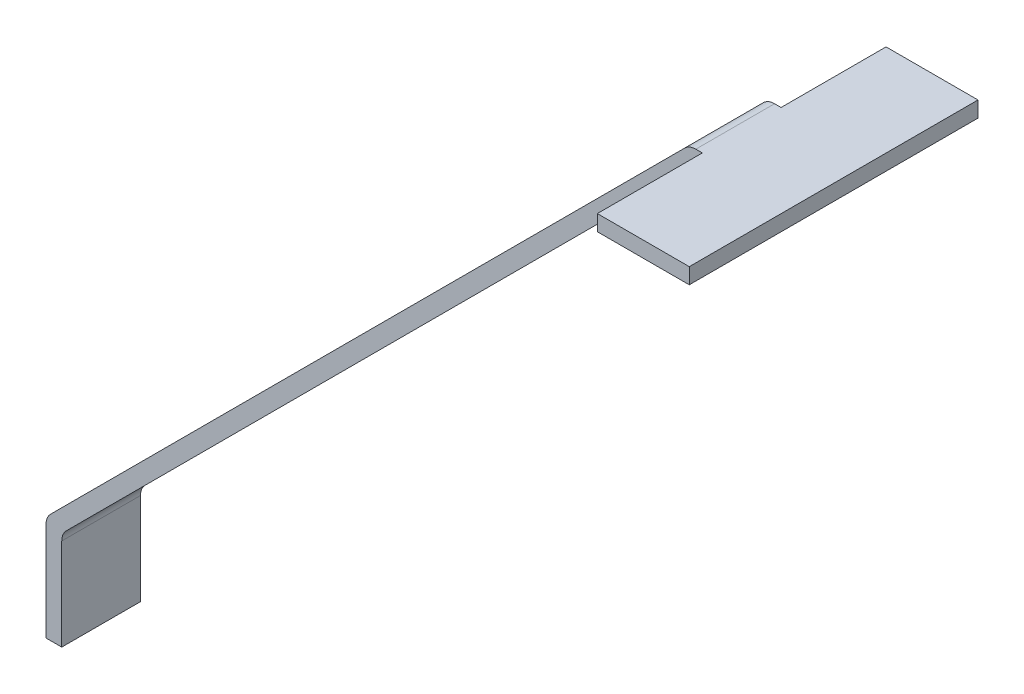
ISO-10303-21;
HEADER;
FILE_DESCRIPTION(('STEP AP214'),'2;1');
FILE_NAME('part.step','',(''),(''),'','','');
FILE_SCHEMA(('AUTOMOTIVE_DESIGN { 1 0 10303 214 1 1 1 1 }'));
ENDSEC;
DATA;
#1=APPLICATION_CONTEXT('core data for automotive mechanical design processes');
#2=APPLICATION_PROTOCOL_DEFINITION('international standard','automotive_design',2000,#1);
#3=PRODUCT_CONTEXT('',#1,'mechanical');
#4=PRODUCT('Part','Part','',(#3));
#5=PRODUCT_RELATED_PRODUCT_CATEGORY('part','',(#4));
#6=PRODUCT_DEFINITION_FORMATION('','',#4);
#7=PRODUCT_DEFINITION_CONTEXT('part definition',#1,'design');
#8=PRODUCT_DEFINITION('design','',#6,#7);
#9=PRODUCT_DEFINITION_SHAPE('','',#8);
#10=(LENGTH_UNIT() NAMED_UNIT(*) SI_UNIT(.MILLI.,.METRE.));
#11=(NAMED_UNIT(*) PLANE_ANGLE_UNIT() SI_UNIT($,.RADIAN.));
#12=(NAMED_UNIT(*) SI_UNIT($,.STERADIAN.) SOLID_ANGLE_UNIT());
#13=UNCERTAINTY_MEASURE_WITH_UNIT(LENGTH_MEASURE(1.E-05),#10,'distance_accuracy_value','');
#14=(GEOMETRIC_REPRESENTATION_CONTEXT(3) GLOBAL_UNCERTAINTY_ASSIGNED_CONTEXT((#13)) GLOBAL_UNIT_ASSIGNED_CONTEXT((#10,
#11,#12)) REPRESENTATION_CONTEXT('',''));
#15=CARTESIAN_POINT('',(0.,0.,0.));
#16=DIRECTION('',(0.,0.,1.));
#17=DIRECTION('',(1.,0.,0.));
#18=AXIS2_PLACEMENT_3D('',#15,#16,#17);
#19=CARTESIAN_POINT('',(0.,0.,15.));
#20=DIRECTION('',(0.,0.,-1.));
#21=DIRECTION('',(-1.,0.,0.));
#22=AXIS2_PLACEMENT_3D('',#19,#20,#21);
#23=PLANE('',#22);
#24=DIRECTION('',(0.,-1.,0.));
#25=VECTOR('',#24,1.);
#26=CARTESIAN_POINT('',(125.026886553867,122.541605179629,15.));
#27=LINE('',#26,#25);
#28=CARTESIAN_POINT('',(125.026886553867,122.541605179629,15.));
#29=VERTEX_POINT('',#28);
#30=CARTESIAN_POINT('',(125.026886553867,119.541605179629,15.));
#31=VERTEX_POINT('',#30);
#32=EDGE_CURVE('E54',#29,#31,#27,.T.);
#33=ORIENTED_EDGE('',*,*,#32,.F.);
#34=DIRECTION('',(-1.,0.,0.));
#35=VECTOR('',#34,1.);
#36=CARTESIAN_POINT('',(122.541605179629,122.541605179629,15.));
#37=LINE('',#36,#35);
#38=CARTESIAN_POINT('',(123.784245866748,122.541605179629,15.));
#39=VERTEX_POINT('',#38);
#40=EDGE_CURVE('E58',#29,#39,#37,.T.);
#41=ORIENTED_EDGE('',*,*,#40,.T.);
#42=CARTESIAN_POINT('',(123.784245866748,119.541605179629,15.));
#43=DIRECTION('',(0.,0.,-1.));
#44=DIRECTION('',(-1.,0.,0.));
#45=AXIS2_PLACEMENT_3D('',#42,#43,#44);
#46=CIRCLE('',#45,3.);
#47=CARTESIAN_POINT('',(121.662925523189,121.662925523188,15.));
#48=VERTEX_POINT('',#47);
#49=EDGE_CURVE('E285',#39,#48,#46,.F.);
#50=ORIENTED_EDGE('',*,*,#49,.T.);
#51=DIRECTION('',(-0.707106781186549,-0.707106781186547,0.));
#52=VECTOR('',#51,1.);
#53=CARTESIAN_POINT('',(0.,0.,15.));
#54=LINE('',#53,#52);
#55=CARTESIAN_POINT('',(0.87867965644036,0.878679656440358,15.));
#56=VERTEX_POINT('',#55);
#57=EDGE_CURVE('E221',#48,#56,#54,.T.);
#58=ORIENTED_EDGE('',*,*,#57,.T.);
#59=CARTESIAN_POINT('',(3.,-1.24264068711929,15.));
#60=DIRECTION('',(0.,0.,-1.));
#61=DIRECTION('',(-1.,0.,0.));
#62=AXIS2_PLACEMENT_3D('',#59,#60,#61);
#63=CIRCLE('',#62,3.);
#64=CARTESIAN_POINT('',(0.,-1.24264068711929,15.));
#65=VERTEX_POINT('',#64);
#66=EDGE_CURVE('E288',#56,#65,#63,.F.);
#67=ORIENTED_EDGE('',*,*,#66,.T.);
#68=DIRECTION('',(0.,-1.,0.));
#69=VECTOR('',#68,1.);
#70=CARTESIAN_POINT('',(0.,-20.,15.));
#71=LINE('',#70,#69);
#72=CARTESIAN_POINT('',(0.,-20.,15.));
#73=VERTEX_POINT('',#72);
#74=EDGE_CURVE('E204',#65,#73,#71,.T.);
#75=ORIENTED_EDGE('',*,*,#74,.T.);
#76=DIRECTION('',(1.,0.,0.));
#77=VECTOR('',#76,1.);
#78=CARTESIAN_POINT('',(3.,-20.,15.));
#79=LINE('',#78,#77);
#80=CARTESIAN_POINT('',(3.,-20.,15.));
#81=VERTEX_POINT('',#80);
#82=EDGE_CURVE('E207',#73,#81,#79,.T.);
#83=ORIENTED_EDGE('',*,*,#82,.T.);
#84=DIRECTION('',(0.,1.,0.));
#85=VECTOR('',#84,1.);
#86=CARTESIAN_POINT('',(3.,-1.24264068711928,15.));
#87=LINE('',#86,#85);
#88=CARTESIAN_POINT('',(3.,-2.48528137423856,15.));
#89=VERTEX_POINT('',#88);
#90=EDGE_CURVE('E211',#81,#89,#87,.T.);
#91=ORIENTED_EDGE('',*,*,#90,.T.);
#92=CARTESIAN_POINT('',(6.00000000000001,-2.48528137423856,15.));
#93=DIRECTION('',(0.,0.,-1.));
#94=DIRECTION('',(-1.,0.,0.));
#95=AXIS2_PLACEMENT_3D('',#92,#93,#94);
#96=CIRCLE('',#95,3.);
#97=CARTESIAN_POINT('',(3.87867965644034,-0.363961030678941,15.));
#98=VERTEX_POINT('',#97);
#99=EDGE_CURVE('E301',#89,#98,#96,.T.);
#100=ORIENTED_EDGE('',*,*,#99,.T.);
#101=DIRECTION('',(0.707106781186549,0.707106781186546,0.));
#102=VECTOR('',#101,1.);
#103=CARTESIAN_POINT('',(123.784245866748,119.541605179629,15.));
#104=LINE('',#103,#102);
#105=CARTESIAN_POINT('',(122.905566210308,118.662925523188,15.));
#106=VERTEX_POINT('',#105);
#107=EDGE_CURVE('E215',#98,#106,#104,.T.);
#108=ORIENTED_EDGE('',*,*,#107,.T.);
#109=CARTESIAN_POINT('',(125.026886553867,116.541605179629,15.));
#110=DIRECTION('',(0.,0.,-1.));
#111=DIRECTION('',(-1.,0.,0.));
#112=AXIS2_PLACEMENT_3D('',#109,#110,#111);
#113=CIRCLE('',#112,3.);
#114=EDGE_CURVE('E11',#106,#31,#113,.T.);
#115=ORIENTED_EDGE('',*,*,#114,.T.);
#116=EDGE_LOOP('',(#33,#41,#50,#58,#67,#75,#83,#91,#100,#108,#115));
#117=FACE_BOUND('',#116,.T.);
#118=ADVANCED_FACE('F39',(#117),#23,.F.);
#119=CARTESIAN_POINT('',(0.,-20.,15.));
#120=DIRECTION('',(1.,0.,0.));
#121=DIRECTION('',(0.,0.,-1.));
#122=AXIS2_PLACEMENT_3D('',#119,#120,#121);
#123=PLANE('',#122);
#124=ORIENTED_EDGE('',*,*,#74,.F.);
#125=DIRECTION('',(0.,0.,-1.));
#126=VECTOR('',#125,1.);
#127=CARTESIAN_POINT('',(0.,-1.24264068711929,15.));
#128=LINE('',#127,#126);
#129=CARTESIAN_POINT('',(0.,-1.24264068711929,0.));
#130=VERTEX_POINT('',#129);
#131=EDGE_CURVE('E267',#65,#130,#128,.T.);
#132=ORIENTED_EDGE('',*,*,#131,.T.);
#133=DIRECTION('',(0.,-1.,0.));
#134=VECTOR('',#133,1.);
#135=CARTESIAN_POINT('',(0.,-20.,0.));
#136=LINE('',#135,#134);
#137=CARTESIAN_POINT('',(0.,-20.,0.));
#138=VERTEX_POINT('',#137);
#139=EDGE_CURVE('E203',#130,#138,#136,.T.);
#140=ORIENTED_EDGE('',*,*,#139,.T.);
#141=DIRECTION('',(0.,0.,-1.));
#142=VECTOR('',#141,1.);
#143=CARTESIAN_POINT('',(0.,-20.,15.));
#144=LINE('',#143,#142);
#145=EDGE_CURVE('E253',#73,#138,#144,.T.);
#146=ORIENTED_EDGE('',*,*,#145,.F.);
#147=EDGE_LOOP('',(#124,#132,#140,#146));
#148=FACE_BOUND('',#147,.T.);
#149=ADVANCED_FACE('F340',(#148),#123,.F.);
#150=CARTESIAN_POINT('',(3.,-20.,15.));
#151=DIRECTION('',(0.,1.,0.));
#152=DIRECTION('',(0.,0.,1.));
#153=AXIS2_PLACEMENT_3D('',#150,#151,#152);
#154=PLANE('',#153);
#155=DIRECTION('',(1.,0.,0.));
#156=VECTOR('',#155,1.);
#157=CARTESIAN_POINT('',(3.,-20.,0.));
#158=LINE('',#157,#156);
#159=CARTESIAN_POINT('',(3.,-20.,0.));
#160=VERTEX_POINT('',#159);
#161=EDGE_CURVE('E227',#138,#160,#158,.T.);
#162=ORIENTED_EDGE('',*,*,#161,.T.);
#163=DIRECTION('',(0.,0.,-1.));
#164=VECTOR('',#163,1.);
#165=CARTESIAN_POINT('',(3.,-20.,15.));
#166=LINE('',#165,#164);
#167=EDGE_CURVE('E249',#81,#160,#166,.T.);
#168=ORIENTED_EDGE('',*,*,#167,.F.);
#169=ORIENTED_EDGE('',*,*,#82,.F.);
#170=ORIENTED_EDGE('',*,*,#145,.T.);
#171=EDGE_LOOP('',(#162,#168,#169,#170));
#172=FACE_BOUND('',#171,.T.);
#173=ADVANCED_FACE('F344',(#172),#154,.F.);
#174=CARTESIAN_POINT('',(3.,-1.24264068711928,15.));
#175=DIRECTION('',(-1.,0.,0.));
#176=DIRECTION('',(0.,-1.,0.));
#177=AXIS2_PLACEMENT_3D('',#174,#175,#176);
#178=PLANE('',#177);
#179=DIRECTION('',(0.,1.,0.));
#180=VECTOR('',#179,1.);
#181=CARTESIAN_POINT('',(3.,-1.24264068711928,0.));
#182=LINE('',#181,#180);
#183=CARTESIAN_POINT('',(3.,-2.48528137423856,0.));
#184=VERTEX_POINT('',#183);
#185=EDGE_CURVE('E230',#160,#184,#182,.T.);
#186=ORIENTED_EDGE('',*,*,#185,.T.);
#187=DIRECTION('',(0.,0.,-1.));
#188=VECTOR('',#187,1.);
#189=CARTESIAN_POINT('',(3.,-2.48528137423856,15.));
#190=LINE('',#189,#188);
#191=EDGE_CURVE('E264',#184,#89,#190,.F.);
#192=ORIENTED_EDGE('',*,*,#191,.T.);
#193=ORIENTED_EDGE('',*,*,#90,.F.);
#194=ORIENTED_EDGE('',*,*,#167,.T.);
#195=EDGE_LOOP('',(#186,#192,#193,#194));
#196=FACE_BOUND('',#195,.T.);
#197=ADVANCED_FACE('F353',(#196),#178,.F.);
#198=CARTESIAN_POINT('',(123.784245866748,119.541605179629,15.));
#199=DIRECTION('',(-0.707106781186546,0.707106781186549,0.));
#200=DIRECTION('',(-0.707106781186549,-0.707106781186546,0.));
#201=AXIS2_PLACEMENT_3D('',#198,#199,#200);
#202=PLANE('',#201);
#203=ORIENTED_EDGE('',*,*,#107,.F.);
#204=DIRECTION('',(0.,0.,-1.));
#205=VECTOR('',#204,1.);
#206=CARTESIAN_POINT('',(3.87867965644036,-0.363961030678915,0.));
#207=LINE('',#206,#205);
#208=CARTESIAN_POINT('',(3.87867965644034,-0.363961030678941,0.));
#209=VERTEX_POINT('',#208);
#210=EDGE_CURVE('E260',#98,#209,#207,.T.);
#211=ORIENTED_EDGE('',*,*,#210,.T.);
#212=DIRECTION('',(0.707106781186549,0.707106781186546,0.));
#213=VECTOR('',#212,1.);
#214=CARTESIAN_POINT('',(123.784245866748,119.541605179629,0.));
#215=LINE('',#214,#213);
#216=CARTESIAN_POINT('',(122.905566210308,118.662925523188,0.));
#217=VERTEX_POINT('',#216);
#218=EDGE_CURVE('E234',#209,#217,#215,.T.);
#219=ORIENTED_EDGE('',*,*,#218,.T.);
#220=DIRECTION('',(0.,0.,-1.));
#221=VECTOR('',#220,1.);
#222=CARTESIAN_POINT('',(122.905566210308,118.662925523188,15.));
#223=LINE('',#222,#221);
#224=EDGE_CURVE('E257',#217,#106,#223,.F.);
#225=ORIENTED_EDGE('',*,*,#224,.T.);
#226=EDGE_LOOP('',(#203,#211,#219,#225));
#227=FACE_BOUND('',#226,.T.);
#228=ADVANCED_FACE('F312',(#227),#202,.F.);
#229=CARTESIAN_POINT('',(142.541605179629,119.541605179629,15.));
#230=DIRECTION('',(0.,1.,0.));
#231=DIRECTION('',(0.,0.,1.));
#232=AXIS2_PLACEMENT_3D('',#229,#230,#231);
#233=PLANE('',#232);
#234=DIRECTION('',(0.,0.,-1.));
#235=VECTOR('',#234,1.);
#236=CARTESIAN_POINT('',(142.541605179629,119.541605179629,15.));
#237=LINE('',#236,#235);
#238=CARTESIAN_POINT('',(142.541605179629,119.541605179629,35.));
#239=VERTEX_POINT('',#238);
#240=CARTESIAN_POINT('',(142.541605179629,119.541605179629,-20.));
#241=VERTEX_POINT('',#240);
#242=EDGE_CURVE('E246',#239,#241,#237,.T.);
#243=ORIENTED_EDGE('',*,*,#242,.F.);
#244=DIRECTION('',(1.,0.,0.));
#245=VECTOR('',#244,1.);
#246=CARTESIAN_POINT('',(125.026886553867,119.541605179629,35.));
#247=LINE('',#246,#245);
#248=CARTESIAN_POINT('',(125.026886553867,119.541605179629,35.));
#249=VERTEX_POINT('',#248);
#250=EDGE_CURVE('E184',#249,#239,#247,.T.);
#251=ORIENTED_EDGE('',*,*,#250,.F.);
#252=DIRECTION('',(0.,0.,-1.));
#253=VECTOR('',#252,1.);
#254=CARTESIAN_POINT('',(125.026886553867,119.541605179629,35.));
#255=LINE('',#254,#253);
#256=EDGE_CURVE('E199',#249,#31,#255,.T.);
#257=ORIENTED_EDGE('',*,*,#256,.T.);
#258=DIRECTION('',(0.,0.,-1.));
#259=VECTOR('',#258,1.);
#260=CARTESIAN_POINT('',(125.026886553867,119.541605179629,0.));
#261=LINE('',#260,#259);
#262=CARTESIAN_POINT('',(125.026886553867,119.541605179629,0.));
#263=VERTEX_POINT('',#262);
#264=EDGE_CURVE('E291',#31,#263,#261,.T.);
#265=ORIENTED_EDGE('',*,*,#264,.T.);
#266=DIRECTION('',(0.,0.,1.));
#267=VECTOR('',#266,1.);
#268=CARTESIAN_POINT('',(125.026886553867,119.541605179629,-20.));
#269=LINE('',#268,#267);
#270=CARTESIAN_POINT('',(125.026886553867,119.541605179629,-20.));
#271=VERTEX_POINT('',#270);
#272=EDGE_CURVE('E172',#271,#263,#269,.T.);
#273=ORIENTED_EDGE('',*,*,#272,.F.);
#274=DIRECTION('',(-1.,0.,0.));
#275=VECTOR('',#274,1.);
#276=CARTESIAN_POINT('',(125.026886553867,119.541605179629,-20.));
#277=LINE('',#276,#275);
#278=EDGE_CURVE('E163',#241,#271,#277,.T.);
#279=ORIENTED_EDGE('',*,*,#278,.F.);
#280=EDGE_LOOP('',(#243,#251,#257,#265,#273,#279));
#281=FACE_BOUND('',#280,.T.);
#282=ADVANCED_FACE('F318',(#281),#233,.F.);
#283=CARTESIAN_POINT('',(142.541605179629,122.541605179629,15.));
#284=DIRECTION('',(-1.,0.,0.));
#285=DIRECTION('',(0.,0.,1.));
#286=AXIS2_PLACEMENT_3D('',#283,#284,#285);
#287=PLANE('',#286);
#288=ORIENTED_EDGE('',*,*,#242,.T.);
#289=DIRECTION('',(0.,-1.,0.));
#290=VECTOR('',#289,1.);
#291=CARTESIAN_POINT('',(142.541605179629,119.541605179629,-20.));
#292=LINE('',#291,#290);
#293=CARTESIAN_POINT('',(142.541605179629,122.541605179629,-20.));
#294=VERTEX_POINT('',#293);
#295=EDGE_CURVE('E157',#294,#241,#292,.T.);
#296=ORIENTED_EDGE('',*,*,#295,.F.);
#297=DIRECTION('',(0.,0.,-1.));
#298=VECTOR('',#297,1.);
#299=CARTESIAN_POINT('',(142.541605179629,122.541605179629,15.));
#300=LINE('',#299,#298);
#301=CARTESIAN_POINT('',(142.541605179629,122.541605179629,35.));
#302=VERTEX_POINT('',#301);
#303=EDGE_CURVE('E152',#302,#294,#300,.T.);
#304=ORIENTED_EDGE('',*,*,#303,.F.);
#305=DIRECTION('',(0.,1.,0.));
#306=VECTOR('',#305,1.);
#307=CARTESIAN_POINT('',(142.541605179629,119.541605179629,35.));
#308=LINE('',#307,#306);
#309=EDGE_CURVE('E188',#239,#302,#308,.T.);
#310=ORIENTED_EDGE('',*,*,#309,.F.);
#311=EDGE_LOOP('',(#288,#296,#304,#310));
#312=FACE_BOUND('',#311,.T.);
#313=ADVANCED_FACE('F379',(#312),#287,.F.);
#314=CARTESIAN_POINT('',(122.541605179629,122.541605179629,15.));
#315=DIRECTION('',(0.,-1.,0.));
#316=DIRECTION('',(0.,0.,-1.));
#317=AXIS2_PLACEMENT_3D('',#314,#315,#316);
#318=PLANE('',#317);
#319=ORIENTED_EDGE('',*,*,#303,.T.);
#320=DIRECTION('',(1.,0.,0.));
#321=VECTOR('',#320,1.);
#322=CARTESIAN_POINT('',(142.541605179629,122.541605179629,-20.));
#323=LINE('',#322,#321);
#324=CARTESIAN_POINT('',(125.026886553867,122.541605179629,-20.));
#325=VERTEX_POINT('',#324);
#326=EDGE_CURVE('E145',#325,#294,#323,.T.);
#327=ORIENTED_EDGE('',*,*,#326,.F.);
#328=DIRECTION('',(0.,0.,1.));
#329=VECTOR('',#328,1.);
#330=CARTESIAN_POINT('',(125.026886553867,122.541605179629,-20.));
#331=LINE('',#330,#329);
#332=CARTESIAN_POINT('',(125.026886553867,122.541605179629,0.));
#333=VERTEX_POINT('',#332);
#334=EDGE_CURVE('E149',#325,#333,#331,.T.);
#335=ORIENTED_EDGE('',*,*,#334,.T.);
#336=DIRECTION('',(-1.,0.,0.));
#337=VECTOR('',#336,1.);
#338=CARTESIAN_POINT('',(122.541605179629,122.541605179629,0.));
#339=LINE('',#338,#337);
#340=CARTESIAN_POINT('',(123.784245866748,122.541605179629,0.));
#341=VERTEX_POINT('',#340);
#342=EDGE_CURVE('E238',#333,#341,#339,.T.);
#343=ORIENTED_EDGE('',*,*,#342,.T.);
#344=DIRECTION('',(0.,0.,-1.));
#345=VECTOR('',#344,1.);
#346=CARTESIAN_POINT('',(123.784245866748,122.541605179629,15.));
#347=LINE('',#346,#345);
#348=EDGE_CURVE('E295',#341,#39,#347,.F.);
#349=ORIENTED_EDGE('',*,*,#348,.T.);
#350=ORIENTED_EDGE('',*,*,#40,.F.);
#351=DIRECTION('',(0.,0.,-1.));
#352=VECTOR('',#351,1.);
#353=CARTESIAN_POINT('',(125.026886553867,122.541605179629,35.));
#354=LINE('',#353,#352);
#355=CARTESIAN_POINT('',(125.026886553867,122.541605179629,35.));
#356=VERTEX_POINT('',#355);
#357=EDGE_CURVE('E194',#356,#29,#354,.T.);
#358=ORIENTED_EDGE('',*,*,#357,.F.);
#359=DIRECTION('',(-1.,0.,0.));
#360=VECTOR('',#359,1.);
#361=CARTESIAN_POINT('',(142.541605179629,122.541605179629,35.));
#362=LINE('',#361,#360);
#363=EDGE_CURVE('E192',#302,#356,#362,.T.);
#364=ORIENTED_EDGE('',*,*,#363,.F.);
#365=EDGE_LOOP('',(#319,#327,#335,#343,#349,#350,#358,#364));
#366=FACE_BOUND('',#365,.T.);
#367=ADVANCED_FACE('F147',(#366),#318,.F.);
#368=CARTESIAN_POINT('',(0.,0.,15.));
#369=DIRECTION('',(0.707106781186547,-0.707106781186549,0.));
#370=DIRECTION('',(0.707106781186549,0.707106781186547,0.));
#371=AXIS2_PLACEMENT_3D('',#368,#369,#370);
#372=PLANE('',#371);
#373=DIRECTION('',(-0.707106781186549,-0.707106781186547,0.));
#374=VECTOR('',#373,1.);
#375=CARTESIAN_POINT('',(0.,0.,0.));
#376=LINE('',#375,#374);
#377=CARTESIAN_POINT('',(121.662925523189,121.662925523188,0.));
#378=VERTEX_POINT('',#377);
#379=CARTESIAN_POINT('',(0.87867965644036,0.878679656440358,0.));
#380=VERTEX_POINT('',#379);
#381=EDGE_CURVE('E208',#378,#380,#376,.T.);
#382=ORIENTED_EDGE('',*,*,#381,.T.);
#383=DIRECTION('',(0.,0.,-1.));
#384=VECTOR('',#383,1.);
#385=CARTESIAN_POINT('',(0.87867965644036,0.878679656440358,15.));
#386=LINE('',#385,#384);
#387=EDGE_CURVE('E282',#380,#56,#386,.F.);
#388=ORIENTED_EDGE('',*,*,#387,.T.);
#389=ORIENTED_EDGE('',*,*,#57,.F.);
#390=DIRECTION('',(0.,0.,-1.));
#391=VECTOR('',#390,1.);
#392=CARTESIAN_POINT('',(121.662925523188,121.662925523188,15.));
#393=LINE('',#392,#391);
#394=EDGE_CURVE('E278',#48,#378,#393,.T.);
#395=ORIENTED_EDGE('',*,*,#394,.T.);
#396=EDGE_LOOP('',(#382,#388,#389,#395));
#397=FACE_BOUND('',#396,.T.);
#398=ADVANCED_FACE('F330',(#397),#372,.F.);
#399=CARTESIAN_POINT('',(0.,0.,0.));
#400=DIRECTION('',(0.,0.,-1.));
#401=DIRECTION('',(-1.,0.,0.));
#402=AXIS2_PLACEMENT_3D('',#399,#400,#401);
#403=PLANE('',#402);
#404=DIRECTION('',(0.,1.,0.));
#405=VECTOR('',#404,1.);
#406=CARTESIAN_POINT('',(125.026886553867,122.541605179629,0.));
#407=LINE('',#406,#405);
#408=EDGE_CURVE('E168',#263,#333,#407,.T.);
#409=ORIENTED_EDGE('',*,*,#408,.F.);
#410=CARTESIAN_POINT('',(125.026886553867,116.541605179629,0.));
#411=DIRECTION('',(0.,0.,-1.));
#412=DIRECTION('',(-1.,0.,0.));
#413=AXIS2_PLACEMENT_3D('',#410,#411,#412);
#414=CIRCLE('',#413,3.);
#415=EDGE_CURVE('E48',#263,#217,#414,.F.);
#416=ORIENTED_EDGE('',*,*,#415,.T.);
#417=ORIENTED_EDGE('',*,*,#218,.F.);
#418=CARTESIAN_POINT('',(6.00000000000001,-2.48528137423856,0.));
#419=DIRECTION('',(0.,0.,-1.));
#420=DIRECTION('',(-1.,0.,0.));
#421=AXIS2_PLACEMENT_3D('',#418,#419,#420);
#422=CIRCLE('',#421,3.);
#423=EDGE_CURVE('E298',#209,#184,#422,.F.);
#424=ORIENTED_EDGE('',*,*,#423,.T.);
#425=ORIENTED_EDGE('',*,*,#185,.F.);
#426=ORIENTED_EDGE('',*,*,#161,.F.);
#427=ORIENTED_EDGE('',*,*,#139,.F.);
#428=CARTESIAN_POINT('',(3.,-1.24264068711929,0.));
#429=DIRECTION('',(0.,0.,-1.));
#430=DIRECTION('',(-1.,0.,0.));
#431=AXIS2_PLACEMENT_3D('',#428,#429,#430);
#432=CIRCLE('',#431,3.);
#433=EDGE_CURVE('E275',#130,#380,#432,.T.);
#434=ORIENTED_EDGE('',*,*,#433,.T.);
#435=ORIENTED_EDGE('',*,*,#381,.F.);
#436=CARTESIAN_POINT('',(123.784245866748,119.541605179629,0.));
#437=DIRECTION('',(0.,0.,-1.));
#438=DIRECTION('',(-1.,0.,0.));
#439=AXIS2_PLACEMENT_3D('',#436,#437,#438);
#440=CIRCLE('',#439,3.);
#441=EDGE_CURVE('E271',#378,#341,#440,.T.);
#442=ORIENTED_EDGE('',*,*,#441,.T.);
#443=ORIENTED_EDGE('',*,*,#342,.F.);
#444=EDGE_LOOP('',(#409,#416,#417,#424,#425,#426,#427,#434,#435,#442,#443));
#445=FACE_BOUND('',#444,.T.);
#446=ADVANCED_FACE('F307',(#445),#403,.T.);
#447=CARTESIAN_POINT('',(6.00000000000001,-2.48528137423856,15.));
#448=DIRECTION('',(0.,0.,1.));
#449=DIRECTION('',(1.,0.,0.));
#450=AXIS2_PLACEMENT_3D('',#447,#448,#449);
#451=CYLINDRICAL_SURFACE('',#450,3.);
#452=ORIENTED_EDGE('',*,*,#99,.F.);
#453=ORIENTED_EDGE('',*,*,#191,.F.);
#454=ORIENTED_EDGE('',*,*,#423,.F.);
#455=ORIENTED_EDGE('',*,*,#210,.F.);
#456=EDGE_LOOP('',(#452,#453,#454,#455));
#457=FACE_BOUND('',#456,.T.);
#458=ADVANCED_FACE('F351',(#457),#451,.F.);
#459=CARTESIAN_POINT('',(3.,-1.24264068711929,15.));
#460=DIRECTION('',(0.,0.,-1.));
#461=DIRECTION('',(-1.,0.,0.));
#462=AXIS2_PLACEMENT_3D('',#459,#460,#461);
#463=CYLINDRICAL_SURFACE('',#462,3.);
#464=ORIENTED_EDGE('',*,*,#66,.F.);
#465=ORIENTED_EDGE('',*,*,#387,.F.);
#466=ORIENTED_EDGE('',*,*,#433,.F.);
#467=ORIENTED_EDGE('',*,*,#131,.F.);
#468=EDGE_LOOP('',(#464,#465,#466,#467));
#469=FACE_BOUND('',#468,.T.);
#470=ADVANCED_FACE('F334',(#469),#463,.T.);
#471=CARTESIAN_POINT('',(125.026886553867,116.541605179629,15.));
#472=DIRECTION('',(0.,0.,1.));
#473=DIRECTION('',(1.,0.,0.));
#474=AXIS2_PLACEMENT_3D('',#471,#472,#473);
#475=CYLINDRICAL_SURFACE('',#474,3.);
#476=ORIENTED_EDGE('',*,*,#114,.F.);
#477=ORIENTED_EDGE('',*,*,#224,.F.);
#478=ORIENTED_EDGE('',*,*,#415,.F.);
#479=ORIENTED_EDGE('',*,*,#264,.F.);
#480=EDGE_LOOP('',(#476,#477,#478,#479));
#481=FACE_BOUND('',#480,.T.);
#482=ADVANCED_FACE('F315',(#481),#475,.F.);
#483=CARTESIAN_POINT('',(123.784245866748,119.541605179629,15.));
#484=DIRECTION('',(0.,0.,-1.));
#485=DIRECTION('',(-1.,0.,0.));
#486=AXIS2_PLACEMENT_3D('',#483,#484,#485);
#487=CYLINDRICAL_SURFACE('',#486,3.);
#488=ORIENTED_EDGE('',*,*,#49,.F.);
#489=ORIENTED_EDGE('',*,*,#348,.F.);
#490=ORIENTED_EDGE('',*,*,#441,.F.);
#491=ORIENTED_EDGE('',*,*,#394,.F.);
#492=EDGE_LOOP('',(#488,#489,#490,#491));
#493=FACE_BOUND('',#492,.T.);
#494=ADVANCED_FACE('F41',(#493),#487,.T.);
#495=CARTESIAN_POINT('',(125.026886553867,122.541605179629,35.));
#496=DIRECTION('',(1.,0.,0.));
#497=DIRECTION('',(0.,0.,-1.));
#498=AXIS2_PLACEMENT_3D('',#495,#496,#497);
#499=PLANE('',#498);
#500=ORIENTED_EDGE('',*,*,#32,.T.);
#501=ORIENTED_EDGE('',*,*,#256,.F.);
#502=DIRECTION('',(0.,-1.,0.));
#503=VECTOR('',#502,1.);
#504=CARTESIAN_POINT('',(125.026886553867,122.541605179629,35.));
#505=LINE('',#504,#503);
#506=EDGE_CURVE('E176',#356,#249,#505,.T.);
#507=ORIENTED_EDGE('',*,*,#506,.F.);
#508=ORIENTED_EDGE('',*,*,#357,.T.);
#509=EDGE_LOOP('',(#500,#501,#507,#508));
#510=FACE_BOUND('',#509,.T.);
#511=ADVANCED_FACE('F321',(#510),#499,.F.);
#512=CARTESIAN_POINT('',(0.,0.,35.));
#513=DIRECTION('',(0.,0.,1.));
#514=DIRECTION('',(1.,0.,0.));
#515=AXIS2_PLACEMENT_3D('',#512,#513,#514);
#516=PLANE('',#515);
#517=ORIENTED_EDGE('',*,*,#506,.T.);
#518=ORIENTED_EDGE('',*,*,#250,.T.);
#519=ORIENTED_EDGE('',*,*,#309,.T.);
#520=ORIENTED_EDGE('',*,*,#363,.T.);
#521=EDGE_LOOP('',(#517,#518,#519,#520));
#522=FACE_BOUND('',#521,.T.);
#523=ADVANCED_FACE('F403',(#522),#516,.T.);
#524=CARTESIAN_POINT('',(125.026886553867,122.541605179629,-20.));
#525=DIRECTION('',(1.,0.,0.));
#526=DIRECTION('',(0.,0.,-1.));
#527=AXIS2_PLACEMENT_3D('',#524,#525,#526);
#528=PLANE('',#527);
#529=ORIENTED_EDGE('',*,*,#408,.T.);
#530=ORIENTED_EDGE('',*,*,#334,.F.);
#531=DIRECTION('',(0.,1.,0.));
#532=VECTOR('',#531,1.);
#533=CARTESIAN_POINT('',(125.026886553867,122.541605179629,-20.));
#534=LINE('',#533,#532);
#535=EDGE_CURVE('E158',#271,#325,#534,.T.);
#536=ORIENTED_EDGE('',*,*,#535,.F.);
#537=ORIENTED_EDGE('',*,*,#272,.T.);
#538=EDGE_LOOP('',(#529,#530,#536,#537));
#539=FACE_BOUND('',#538,.T.);
#540=ADVANCED_FACE('F170',(#539),#528,.F.);
#541=CARTESIAN_POINT('',(0.,0.,-20.));
#542=DIRECTION('',(0.,0.,1.));
#543=DIRECTION('',(1.,0.,0.));
#544=AXIS2_PLACEMENT_3D('',#541,#542,#543);
#545=PLANE('',#544);
#546=ORIENTED_EDGE('',*,*,#535,.T.);
#547=ORIENTED_EDGE('',*,*,#326,.T.);
#548=ORIENTED_EDGE('',*,*,#295,.T.);
#549=ORIENTED_EDGE('',*,*,#278,.T.);
#550=EDGE_LOOP('',(#546,#547,#548,#549));
#551=FACE_BOUND('',#550,.T.);
#552=ADVANCED_FACE('F161',(#551),#545,.F.);
#553=CLOSED_SHELL('',(#118,#149,#173,#197,#228,#282,#313,#367,#398,#446,#458,#470,#482,#494,
#511,#523,#540,#552));
#554=MANIFOLD_SOLID_BREP('B2',#553);
#555=ADVANCED_BREP_SHAPE_REPRESENTATION('',(#18,#554),#14);
#556=SHAPE_DEFINITION_REPRESENTATION(#9,#555);
ENDSEC;
END-ISO-10303-21;
